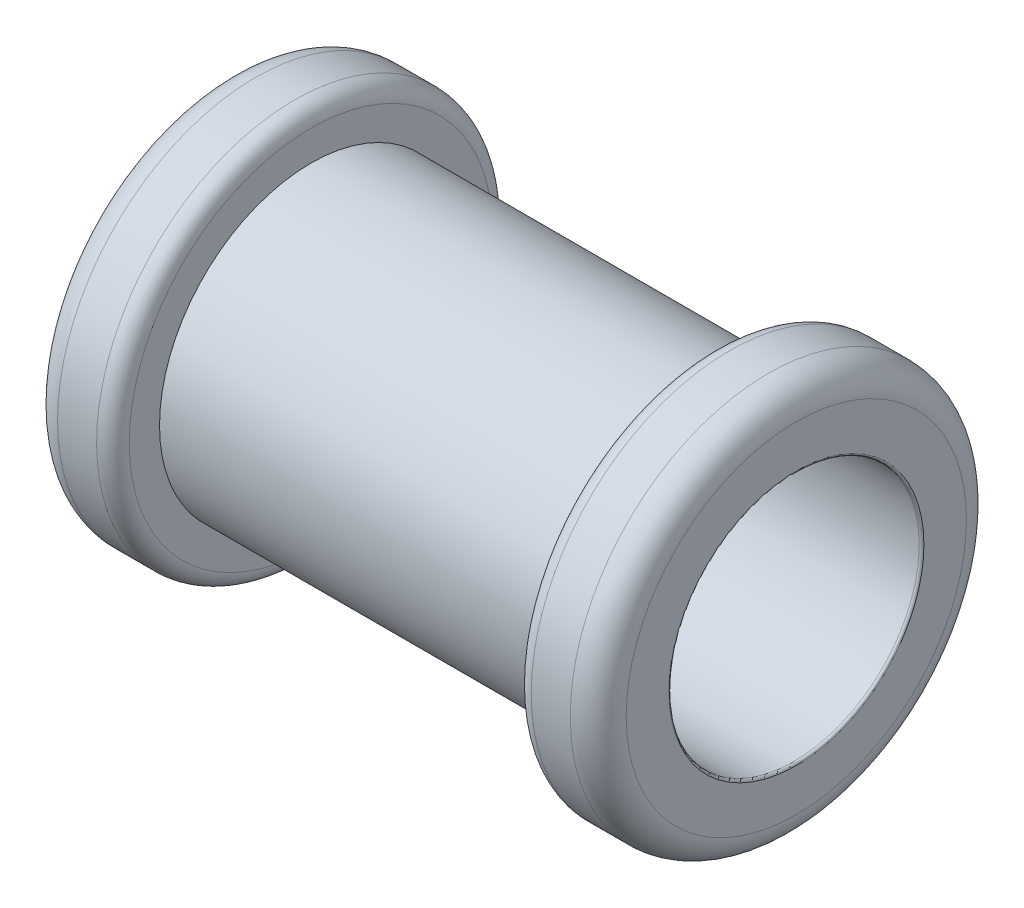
ISO-10303-21;
HEADER;
FILE_DESCRIPTION(('STEP AP214'),'2;1');
FILE_NAME('part.step','',(''),(''),'','','');
FILE_SCHEMA(('AUTOMOTIVE_DESIGN { 1 0 10303 214 1 1 1 1 }'));
ENDSEC;
DATA;
#1=APPLICATION_CONTEXT('core data for automotive mechanical design processes');
#2=APPLICATION_PROTOCOL_DEFINITION('international standard','automotive_design',2000,#1);
#3=PRODUCT_CONTEXT('',#1,'mechanical');
#4=PRODUCT('Part','Part','',(#3));
#5=PRODUCT_RELATED_PRODUCT_CATEGORY('part','',(#4));
#6=PRODUCT_DEFINITION_FORMATION('','',#4);
#7=PRODUCT_DEFINITION_CONTEXT('part definition',#1,'design');
#8=PRODUCT_DEFINITION('design','',#6,#7);
#9=PRODUCT_DEFINITION_SHAPE('','',#8);
#10=(LENGTH_UNIT() NAMED_UNIT(*) SI_UNIT(.MILLI.,.METRE.));
#11=(NAMED_UNIT(*) PLANE_ANGLE_UNIT() SI_UNIT($,.RADIAN.));
#12=(NAMED_UNIT(*) SI_UNIT($,.STERADIAN.) SOLID_ANGLE_UNIT());
#13=UNCERTAINTY_MEASURE_WITH_UNIT(LENGTH_MEASURE(1.E-05),#10,'distance_accuracy_value','');
#14=(GEOMETRIC_REPRESENTATION_CONTEXT(3) GLOBAL_UNCERTAINTY_ASSIGNED_CONTEXT((#13)) GLOBAL_UNIT_ASSIGNED_CONTEXT((#10,
#11,#12)) REPRESENTATION_CONTEXT('',''));
#15=CARTESIAN_POINT('',(0.,0.,0.));
#16=DIRECTION('',(0.,0.,1.));
#17=DIRECTION('',(1.,0.,0.));
#18=AXIS2_PLACEMENT_3D('',#15,#16,#17);
#19=CARTESIAN_POINT('',(-42.536858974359,0.,0.));
#20=DIRECTION('',(-1.,0.,0.));
#21=DIRECTION('',(0.,0.,1.));
#22=AXIS2_PLACEMENT_3D('',#19,#20,#21);
#23=CYLINDRICAL_SURFACE('',#22,10.75);
#24=CARTESIAN_POINT('',(-12.9120777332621,0.,0.));
#25=DIRECTION('',(-1.,0.,0.));
#26=DIRECTION('',(0.,0.,1.));
#27=AXIS2_PLACEMENT_3D('',#24,#25,#26);
#28=CIRCLE('',#27,10.75);
#29=CARTESIAN_POINT('',(-12.9120777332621,0.,10.75));
#30=VERTEX_POINT('',#29);
#31=EDGE_CURVE('E10',#30,#30,#28,.T.);
#32=ORIENTED_EDGE('',*,*,#31,.T.);
#33=EDGE_LOOP('',(#32));
#34=FACE_BOUND('',#33,.T.);
#35=CARTESIAN_POINT('',(35.4879222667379,0.,0.));
#36=DIRECTION('',(-1.,0.,0.));
#37=DIRECTION('',(0.,0.,1.));
#38=AXIS2_PLACEMENT_3D('',#35,#36,#37);
#39=CIRCLE('',#38,10.75);
#40=CARTESIAN_POINT('',(35.4879222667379,0.,10.75));
#41=VERTEX_POINT('',#40);
#42=EDGE_CURVE('E56',#41,#41,#39,.T.);
#43=ORIENTED_EDGE('',*,*,#42,.F.);
#44=EDGE_LOOP('',(#43));
#45=FACE_BOUND('',#44,.T.);
#46=ADVANCED_FACE('F28',(#34,#45),#23,.F.);
#47=CARTESIAN_POINT('',(-12.9120777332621,0.,0.));
#48=DIRECTION('',(-1.,0.,0.));
#49=DIRECTION('',(0.,0.,1.));
#50=AXIS2_PLACEMENT_3D('',#47,#48,#49);
#51=TOROIDAL_SURFACE('',#50,10.95,0.200000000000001);
#52=ORIENTED_EDGE('',*,*,#31,.F.);
#53=EDGE_LOOP('',(#52));
#54=FACE_BOUND('',#53,.T.);
#55=CARTESIAN_POINT('',(-13.1120777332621,0.,0.));
#56=DIRECTION('',(-1.,0.,0.));
#57=DIRECTION('',(0.,0.,1.));
#58=AXIS2_PLACEMENT_3D('',#55,#56,#57);
#59=CIRCLE('',#58,10.95);
#60=CARTESIAN_POINT('',(-13.1120777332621,0.,10.95));
#61=VERTEX_POINT('',#60);
#62=EDGE_CURVE('E34',#61,#61,#59,.T.);
#63=ORIENTED_EDGE('',*,*,#62,.T.);
#64=EDGE_LOOP('',(#63));
#65=FACE_BOUND('',#64,.T.);
#66=ADVANCED_FACE('F92',(#54,#65),#51,.T.);
#67=CARTESIAN_POINT('',(-13.1120777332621,10.95,0.));
#68=DIRECTION('',(1.,0.,0.));
#69=DIRECTION('',(0.,0.,-1.));
#70=AXIS2_PLACEMENT_3D('',#67,#68,#69);
#71=PLANE('',#70);
#72=ORIENTED_EDGE('',*,*,#62,.F.);
#73=EDGE_LOOP('',(#72));
#74=FACE_BOUND('',#73,.T.);
#75=CARTESIAN_POINT('',(-13.1120777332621,0.,0.));
#76=DIRECTION('',(-1.,0.,0.));
#77=DIRECTION('',(0.,0.,1.));
#78=AXIS2_PLACEMENT_3D('',#75,#76,#77);
#79=CIRCLE('',#78,14.6);
#80=CARTESIAN_POINT('',(-13.1120777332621,0.,14.6));
#81=VERTEX_POINT('',#80);
#82=EDGE_CURVE('E38',#81,#81,#79,.T.);
#83=ORIENTED_EDGE('',*,*,#82,.T.);
#84=EDGE_LOOP('',(#83));
#85=FACE_BOUND('',#84,.T.);
#86=ADVANCED_FACE('F96',(#74,#85),#71,.F.);
#87=CARTESIAN_POINT('',(-10.7120777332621,0.,0.));
#88=DIRECTION('',(-1.,0.,0.));
#89=DIRECTION('',(0.,0.,1.));
#90=AXIS2_PLACEMENT_3D('',#87,#88,#89);
#91=TOROIDAL_SURFACE('',#90,14.6,2.4);
#92=ORIENTED_EDGE('',*,*,#82,.F.);
#93=EDGE_LOOP('',(#92));
#94=FACE_BOUND('',#93,.T.);
#95=CARTESIAN_POINT('',(-10.7120777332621,0.,0.));
#96=DIRECTION('',(-1.,0.,0.));
#97=DIRECTION('',(0.,0.,1.));
#98=AXIS2_PLACEMENT_3D('',#95,#96,#97);
#99=CIRCLE('',#98,17.);
#100=CARTESIAN_POINT('',(-10.7120777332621,0.,17.));
#101=VERTEX_POINT('',#100);
#102=EDGE_CURVE('E42',#101,#101,#99,.T.);
#103=ORIENTED_EDGE('',*,*,#102,.T.);
#104=EDGE_LOOP('',(#103));
#105=FACE_BOUND('',#104,.T.);
#106=ADVANCED_FACE('F142',(#94,#105),#91,.T.);
#107=CARTESIAN_POINT('',(-42.536858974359,0.,0.));
#108=DIRECTION('',(-1.,0.,0.));
#109=DIRECTION('',(0.,0.,1.));
#110=AXIS2_PLACEMENT_3D('',#107,#108,#109);
#111=CYLINDRICAL_SURFACE('',#110,17.);
#112=ORIENTED_EDGE('',*,*,#102,.F.);
#113=EDGE_LOOP('',(#112));
#114=FACE_BOUND('',#113,.T.);
#115=CARTESIAN_POINT('',(-7.3620777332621,0.,0.));
#116=DIRECTION('',(-1.,0.,0.));
#117=DIRECTION('',(0.,0.,1.));
#118=AXIS2_PLACEMENT_3D('',#115,#116,#117);
#119=CIRCLE('',#118,17.);
#120=CARTESIAN_POINT('',(-7.3620777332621,0.,17.));
#121=VERTEX_POINT('',#120);
#122=EDGE_CURVE('E47',#121,#121,#119,.T.);
#123=ORIENTED_EDGE('',*,*,#122,.T.);
#124=EDGE_LOOP('',(#123));
#125=FACE_BOUND('',#124,.T.);
#126=ADVANCED_FACE('F138',(#114,#125),#111,.T.);
#127=CARTESIAN_POINT('',(-7.3620777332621,0.,0.));
#128=DIRECTION('',(-1.,0.,0.));
#129=DIRECTION('',(0.,0.,1.));
#130=AXIS2_PLACEMENT_3D('',#127,#128,#129);
#131=TOROIDAL_SURFACE('',#130,15.6,1.4);
#132=ORIENTED_EDGE('',*,*,#122,.F.);
#133=EDGE_LOOP('',(#132));
#134=FACE_BOUND('',#133,.T.);
#135=CARTESIAN_POINT('',(-5.9620777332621,0.,0.));
#136=DIRECTION('',(-1.,0.,0.));
#137=DIRECTION('',(0.,0.,1.));
#138=AXIS2_PLACEMENT_3D('',#135,#136,#137);
#139=CIRCLE('',#138,15.6);
#140=CARTESIAN_POINT('',(-5.9620777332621,0.,15.6));
#141=VERTEX_POINT('',#140);
#142=EDGE_CURVE('E50',#141,#141,#139,.T.);
#143=ORIENTED_EDGE('',*,*,#142,.T.);
#144=EDGE_LOOP('',(#143));
#145=FACE_BOUND('',#144,.T.);
#146=ADVANCED_FACE('F134',(#134,#145),#131,.T.);
#147=CARTESIAN_POINT('',(-5.9620777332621,15.6,0.));
#148=DIRECTION('',(-1.,0.,0.));
#149=DIRECTION('',(0.,0.,1.));
#150=AXIS2_PLACEMENT_3D('',#147,#148,#149);
#151=PLANE('',#150);
#152=ORIENTED_EDGE('',*,*,#142,.F.);
#153=EDGE_LOOP('',(#152));
#154=FACE_BOUND('',#153,.T.);
#155=CARTESIAN_POINT('',(-5.9620777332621,0.,0.));
#156=DIRECTION('',(-1.,0.,0.));
#157=DIRECTION('',(0.,0.,1.));
#158=AXIS2_PLACEMENT_3D('',#155,#156,#157);
#159=CIRCLE('',#158,13.);
#160=CARTESIAN_POINT('',(-5.9620777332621,0.,13.));
#161=VERTEX_POINT('',#160);
#162=EDGE_CURVE('E53',#161,#161,#159,.T.);
#163=ORIENTED_EDGE('',*,*,#162,.T.);
#164=EDGE_LOOP('',(#163));
#165=FACE_BOUND('',#164,.T.);
#166=ADVANCED_FACE('F130',(#154,#165),#151,.F.);
#167=CARTESIAN_POINT('',(-42.536858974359,0.,0.));
#168=DIRECTION('',(-1.,0.,0.));
#169=DIRECTION('',(0.,0.,1.));
#170=AXIS2_PLACEMENT_3D('',#167,#168,#169);
#171=CYLINDRICAL_SURFACE('',#170,13.);
#172=ORIENTED_EDGE('',*,*,#162,.F.);
#173=EDGE_LOOP('',(#172));
#174=FACE_BOUND('',#173,.T.);
#175=CARTESIAN_POINT('',(28.5379222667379,0.,0.));
#176=DIRECTION('',(-1.,0.,0.));
#177=DIRECTION('',(0.,0.,1.));
#178=AXIS2_PLACEMENT_3D('',#175,#176,#177);
#179=CIRCLE('',#178,13.);
#180=CARTESIAN_POINT('',(28.5379222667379,0.,13.));
#181=VERTEX_POINT('',#180);
#182=EDGE_CURVE('E74',#181,#181,#179,.T.);
#183=ORIENTED_EDGE('',*,*,#182,.T.);
#184=EDGE_LOOP('',(#183));
#185=FACE_BOUND('',#184,.T.);
#186=ADVANCED_FACE('F78',(#174,#185),#171,.T.);
#187=CARTESIAN_POINT('',(35.4879222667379,0.,0.));
#188=DIRECTION('',(1.,0.,0.));
#189=DIRECTION('',(0.,0.,1.));
#190=AXIS2_PLACEMENT_3D('',#187,#188,#189);
#191=TOROIDAL_SURFACE('',#190,10.95,0.200000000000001);
#192=ORIENTED_EDGE('',*,*,#42,.T.);
#193=EDGE_LOOP('',(#192));
#194=FACE_BOUND('',#193,.T.);
#195=CARTESIAN_POINT('',(35.6879222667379,0.,0.));
#196=DIRECTION('',(-1.,0.,0.));
#197=DIRECTION('',(0.,0.,1.));
#198=AXIS2_PLACEMENT_3D('',#195,#196,#197);
#199=CIRCLE('',#198,10.95);
#200=CARTESIAN_POINT('',(35.6879222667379,0.,10.95));
#201=VERTEX_POINT('',#200);
#202=EDGE_CURVE('E59',#201,#201,#199,.T.);
#203=ORIENTED_EDGE('',*,*,#202,.F.);
#204=EDGE_LOOP('',(#203));
#205=FACE_BOUND('',#204,.T.);
#206=ADVANCED_FACE('F101',(#194,#205),#191,.T.);
#207=CARTESIAN_POINT('',(35.6879222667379,10.95,0.));
#208=DIRECTION('',(-1.,0.,0.));
#209=DIRECTION('',(0.,0.,-1.));
#210=AXIS2_PLACEMENT_3D('',#207,#208,#209);
#211=PLANE('',#210);
#212=ORIENTED_EDGE('',*,*,#202,.T.);
#213=EDGE_LOOP('',(#212));
#214=FACE_BOUND('',#213,.T.);
#215=CARTESIAN_POINT('',(35.6879222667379,0.,0.));
#216=DIRECTION('',(-1.,0.,0.));
#217=DIRECTION('',(0.,0.,1.));
#218=AXIS2_PLACEMENT_3D('',#215,#216,#217);
#219=CIRCLE('',#218,14.6);
#220=CARTESIAN_POINT('',(35.6879222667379,0.,14.6));
#221=VERTEX_POINT('',#220);
#222=EDGE_CURVE('E62',#221,#221,#219,.T.);
#223=ORIENTED_EDGE('',*,*,#222,.F.);
#224=EDGE_LOOP('',(#223));
#225=FACE_BOUND('',#224,.T.);
#226=ADVANCED_FACE('F104',(#214,#225),#211,.F.);
#227=CARTESIAN_POINT('',(33.2879222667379,0.,0.));
#228=DIRECTION('',(1.,0.,0.));
#229=DIRECTION('',(0.,0.,1.));
#230=AXIS2_PLACEMENT_3D('',#227,#228,#229);
#231=TOROIDAL_SURFACE('',#230,14.6,2.4);
#232=ORIENTED_EDGE('',*,*,#222,.T.);
#233=EDGE_LOOP('',(#232));
#234=FACE_BOUND('',#233,.T.);
#235=CARTESIAN_POINT('',(33.2879222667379,0.,0.));
#236=DIRECTION('',(-1.,0.,0.));
#237=DIRECTION('',(0.,0.,1.));
#238=AXIS2_PLACEMENT_3D('',#235,#236,#237);
#239=CIRCLE('',#238,17.);
#240=CARTESIAN_POINT('',(33.2879222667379,0.,17.));
#241=VERTEX_POINT('',#240);
#242=EDGE_CURVE('E65',#241,#241,#239,.T.);
#243=ORIENTED_EDGE('',*,*,#242,.F.);
#244=EDGE_LOOP('',(#243));
#245=FACE_BOUND('',#244,.T.);
#246=ADVANCED_FACE('F110',(#234,#245),#231,.T.);
#247=CARTESIAN_POINT('',(65.1127035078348,0.,0.));
#248=DIRECTION('',(1.,0.,0.));
#249=DIRECTION('',(0.,0.,1.));
#250=AXIS2_PLACEMENT_3D('',#247,#248,#249);
#251=CYLINDRICAL_SURFACE('',#250,17.);
#252=ORIENTED_EDGE('',*,*,#242,.T.);
#253=EDGE_LOOP('',(#252));
#254=FACE_BOUND('',#253,.T.);
#255=CARTESIAN_POINT('',(29.9379222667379,0.,0.));
#256=DIRECTION('',(-1.,0.,0.));
#257=DIRECTION('',(0.,0.,1.));
#258=AXIS2_PLACEMENT_3D('',#255,#256,#257);
#259=CIRCLE('',#258,17.);
#260=CARTESIAN_POINT('',(29.9379222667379,0.,17.));
#261=VERTEX_POINT('',#260);
#262=EDGE_CURVE('E68',#261,#261,#259,.T.);
#263=ORIENTED_EDGE('',*,*,#262,.F.);
#264=EDGE_LOOP('',(#263));
#265=FACE_BOUND('',#264,.T.);
#266=ADVANCED_FACE('F88',(#254,#265),#251,.T.);
#267=CARTESIAN_POINT('',(29.9379222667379,0.,0.));
#268=DIRECTION('',(1.,0.,0.));
#269=DIRECTION('',(0.,0.,1.));
#270=AXIS2_PLACEMENT_3D('',#267,#268,#269);
#271=TOROIDAL_SURFACE('',#270,15.6,1.4);
#272=ORIENTED_EDGE('',*,*,#262,.T.);
#273=EDGE_LOOP('',(#272));
#274=FACE_BOUND('',#273,.T.);
#275=CARTESIAN_POINT('',(28.5379222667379,0.,0.));
#276=DIRECTION('',(-1.,0.,0.));
#277=DIRECTION('',(0.,0.,1.));
#278=AXIS2_PLACEMENT_3D('',#275,#276,#277);
#279=CIRCLE('',#278,15.6);
#280=CARTESIAN_POINT('',(28.5379222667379,0.,15.6));
#281=VERTEX_POINT('',#280);
#282=EDGE_CURVE('E71',#281,#281,#279,.T.);
#283=ORIENTED_EDGE('',*,*,#282,.F.);
#284=EDGE_LOOP('',(#283));
#285=FACE_BOUND('',#284,.T.);
#286=ADVANCED_FACE('F82',(#274,#285),#271,.T.);
#287=CARTESIAN_POINT('',(28.5379222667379,15.6,0.));
#288=DIRECTION('',(1.,0.,0.));
#289=DIRECTION('',(0.,0.,1.));
#290=AXIS2_PLACEMENT_3D('',#287,#288,#289);
#291=PLANE('',#290);
#292=ORIENTED_EDGE('',*,*,#282,.T.);
#293=EDGE_LOOP('',(#292));
#294=FACE_BOUND('',#293,.T.);
#295=ORIENTED_EDGE('',*,*,#182,.F.);
#296=EDGE_LOOP('',(#295));
#297=FACE_BOUND('',#296,.T.);
#298=ADVANCED_FACE('F80',(#294,#297),#291,.F.);
#299=CLOSED_SHELL('',(#46,#66,#86,#106,#126,#146,#166,#186,#206,#226,#246,#266,#286,#298));
#300=MANIFOLD_SOLID_BREP('B2',#299);
#301=ADVANCED_BREP_SHAPE_REPRESENTATION('',(#18,#300),#14);
#302=SHAPE_DEFINITION_REPRESENTATION(#9,#301);
ENDSEC;
END-ISO-10303-21;
